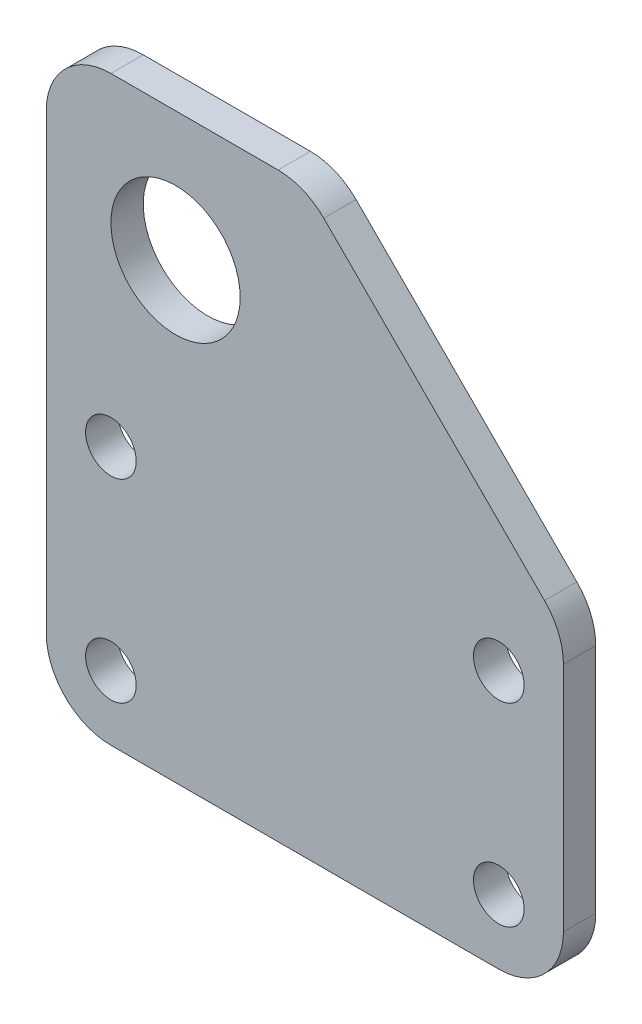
from build123d import *

# Parameters (mm, degrees)
SKETCH1_R           = 2.4892
SKETCH1_R_2         = 6.35
BOSS_EXTRUDE1_DEPTH = 3.175
FILLET1_R           = 6.35


with BuildPart() as part:
    # Sketch1 → Boss-Extrude1 (new body)
    with BuildSketch(Plane.XY):
        Polygon((50.8, 0), (0, 0), (0, 57.15), (25.4, 57.15), (50.8, 31.75), align=None)
        with Locations((6.35, 25.4)):
            Circle(SKETCH1_R, mode=Mode.SUBTRACT)
        with Locations((44.45, 25.4)):
            Circle(SKETCH1_R, mode=Mode.SUBTRACT)
        with Locations((44.45, 6.35)):
            Circle(SKETCH1_R, mode=Mode.SUBTRACT)
        with Locations((6.35, 6.35)):
            Circle(SKETCH1_R, mode=Mode.SUBTRACT)
        with Locations((12.7, 44.45)):
            Circle(SKETCH1_R_2, mode=Mode.SUBTRACT)
    extrude(amount=BOSS_EXTRUDE1_DEPTH)

    # Fillet1
    fillet1_edges = [part.edges().sort_by_distance(p)[0] for p in [
        (50.8, 0, 1.5875),
        (0, 0, 1.5875),
        (0, 57.15, 1.5875),
        (25.4, 57.15, 1.5875),
        (50.8, 31.75, 1.5875),
    ]]
    fillet(fillet1_edges, radius=FILLET1_R)


solid = part.part
